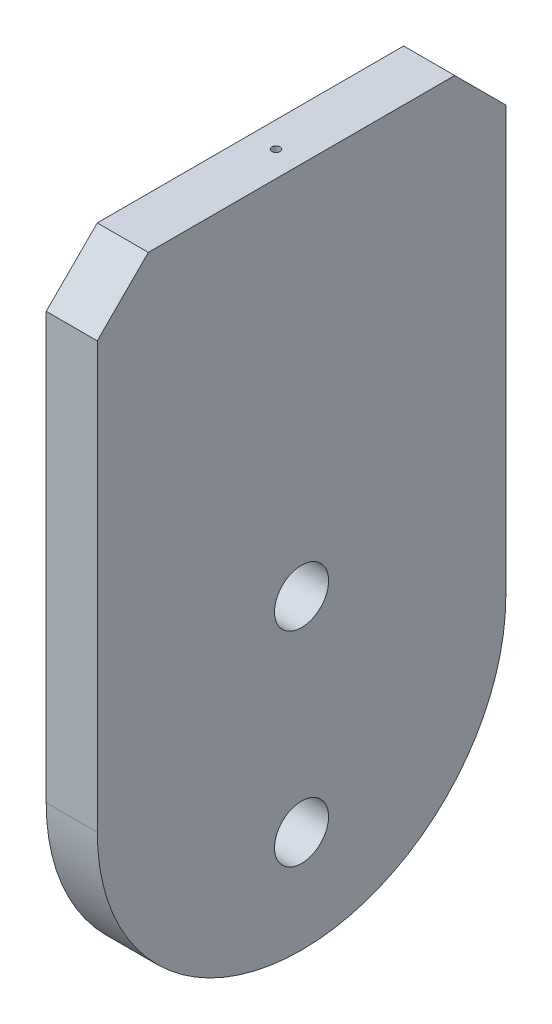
from build123d import *

# Parameters (mm, degrees)
BASE_EXTRUDE_DEPTH = 4.7625
CHAMFER1_SIZE      = 9.525
SKETCH2_R          = 0.762
CUT_EXTRUDE1_DEPTH = 6.35
F_3_8_CLEARANCE_D  = 10.083791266
LPATTERN1_COUNT    = 2
LPATTERN1_PITCH    = 38.1


with BuildPart() as part:
    # Sketch1 → Base-Extrude (new, symmetric)
    with BuildSketch(Plane(origin=(0, 0, 0), x_dir=(0, 0, -1), z_dir=(1, 0, 0))):
        with BuildLine():
            Line((-38.1, 88.9), (38.1, 88.9))
            Line((38.1, 88.9), (38.1, 0))
            ThreePointArc((38.1, 0), (0, -38.1), (-38.1, 0))
            Line((-38.1, 0), (-38.1, 88.9))
        make_face()
    extrude(amount=BASE_EXTRUDE_DEPTH, both=True)

    # Chamfer1
    chamfer1_edges = [part.edges().sort_by_distance(p)[0] for p in [
        (0, 88.9, 38.1),
        (0, 88.9, -38.1),
    ]]
    chamfer(chamfer1_edges, length=CHAMFER1_SIZE)

    # Sketch2 → Cut-Extrude1 (cut)
    with BuildSketch(Plane(origin=(0, 88.9, 0), x_dir=(-1, 0, 0), z_dir=(0, 1, 0))):
        with Locations(Location((0, 0, 0), (0, 0, 90))):
            Circle(SKETCH2_R)
    extrude(amount=-CUT_EXTRUDE1_DEPTH, mode=Mode.SUBTRACT)

    # 3.8-Clearance (through all)
    with Locations(Plane(origin=(4.7625, 0, 0), x_dir=(0, 0, -1), z_dir=(1, 0, 0))):
        with Locations((0, -19.05)):
            f_3_8_clearance = Hole(F_3_8_CLEARANCE_D / 2)

    # LPattern1: 3.8-Clearance ×2
    with Locations(*[(0, i * LPATTERN1_PITCH, 0) for i in range(1, LPATTERN1_COUNT)]):
        add(f_3_8_clearance, mode=Mode.SUBTRACT)


solid = part.part
